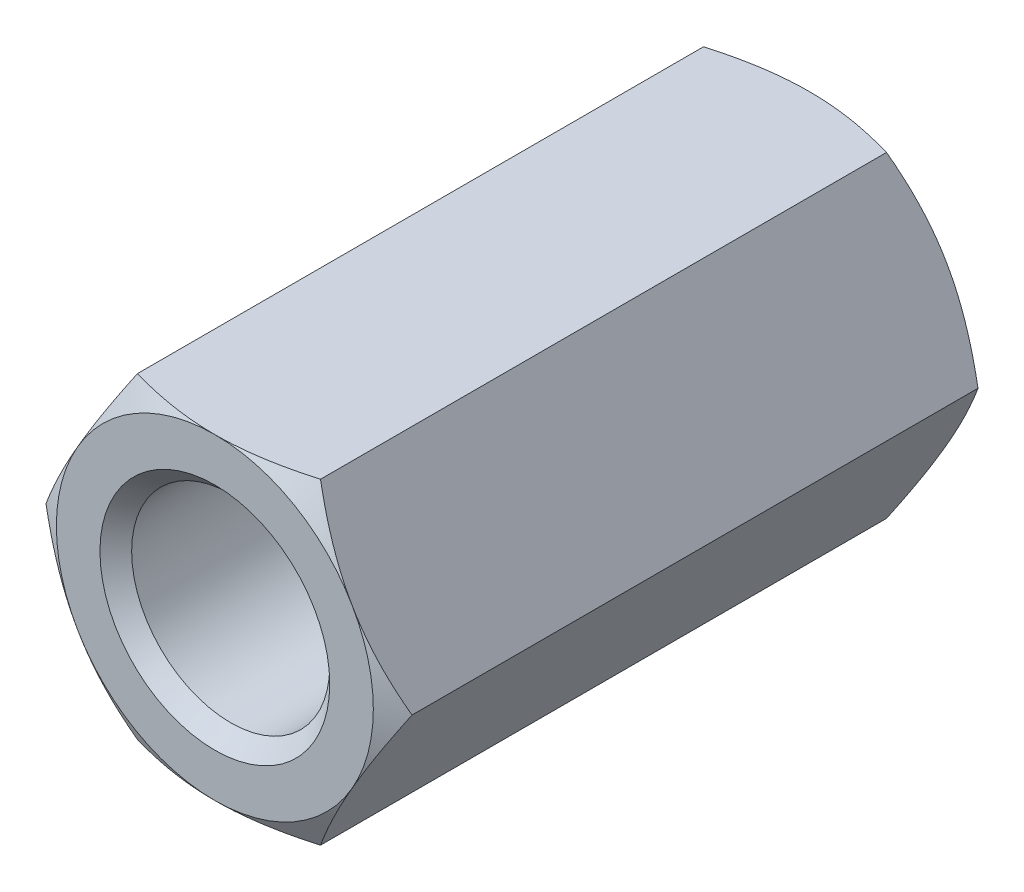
ISO-10303-21;
HEADER;
FILE_DESCRIPTION(('STEP AP214'),'2;1');
FILE_NAME('part.step','',(''),(''),'','','');
FILE_SCHEMA(('AUTOMOTIVE_DESIGN { 1 0 10303 214 1 1 1 1 }'));
ENDSEC;
DATA;
#1=APPLICATION_CONTEXT('core data for automotive mechanical design processes');
#2=APPLICATION_PROTOCOL_DEFINITION('international standard','automotive_design',2000,#1);
#3=PRODUCT_CONTEXT('',#1,'mechanical');
#4=PRODUCT('Part','Part','',(#3));
#5=PRODUCT_RELATED_PRODUCT_CATEGORY('part','',(#4));
#6=PRODUCT_DEFINITION_FORMATION('','',#4);
#7=PRODUCT_DEFINITION_CONTEXT('part definition',#1,'design');
#8=PRODUCT_DEFINITION('design','',#6,#7);
#9=PRODUCT_DEFINITION_SHAPE('','',#8);
#10=(LENGTH_UNIT() NAMED_UNIT(*) SI_UNIT(.MILLI.,.METRE.));
#11=(NAMED_UNIT(*) PLANE_ANGLE_UNIT() SI_UNIT($,.RADIAN.));
#12=(NAMED_UNIT(*) SI_UNIT($,.STERADIAN.) SOLID_ANGLE_UNIT());
#13=UNCERTAINTY_MEASURE_WITH_UNIT(LENGTH_MEASURE(1.E-05),#10,'distance_accuracy_value','');
#14=(GEOMETRIC_REPRESENTATION_CONTEXT(3) GLOBAL_UNCERTAINTY_ASSIGNED_CONTEXT((#13)) GLOBAL_UNIT_ASSIGNED_CONTEXT((#10,
#11,#12)) REPRESENTATION_CONTEXT('',''));
#15=CARTESIAN_POINT('',(0.,0.,0.));
#16=DIRECTION('',(0.,0.,1.));
#17=DIRECTION('',(1.,0.,0.));
#18=AXIS2_PLACEMENT_3D('',#15,#16,#17);
#19=CARTESIAN_POINT('',(4.61880215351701,0.,-7.5));
#20=DIRECTION('',(0.866025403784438,0.5,0.));
#21=DIRECTION('',(-0.5,0.866025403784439,0.));
#22=AXIS2_PLACEMENT_3D('',#19,#20,#21);
#23=PLANE('',#22);
#24=CARTESIAN_POINT('',(4.61891762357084,-0.000199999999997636,7.14266774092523));
#25=CARTESIAN_POINT('',(4.5174314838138,0.17557915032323,7.20128212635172));
#26=CARTESIAN_POINT('',(4.41506932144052,0.352875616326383,7.25458967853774));
#27=CARTESIAN_POINT('',(4.20857250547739,0.710538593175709,7.3476383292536));
#28=CARTESIAN_POINT('',(4.10443418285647,0.890911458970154,7.3873465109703));
#29=CARTESIAN_POINT('',(3.89744813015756,1.24942181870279,7.44915778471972));
#30=CARTESIAN_POINT('',(3.79463224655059,1.42750415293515,7.47167226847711));
#31=CARTESIAN_POINT('',(3.58851671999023,1.78450671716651,7.49854937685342));
#32=CARTESIAN_POINT('',(3.48521782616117,1.9634256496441,7.50293425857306));
#33=CARTESIAN_POINT('',(3.29219970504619,2.29774284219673,7.49380992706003));
#34=CARTESIAN_POINT('',(3.20245157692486,2.45319115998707,7.48254104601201));
#35=CARTESIAN_POINT('',(3.02354002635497,2.76307505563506,7.44682600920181));
#36=CARTESIAN_POINT('',(2.93437722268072,2.91750956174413,7.42236765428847));
#37=CARTESIAN_POINT('',(2.75509682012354,3.22803232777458,7.36122393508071));
#38=CARTESIAN_POINT('',(2.6650019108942,3.3840812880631,7.32427939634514));
#39=CARTESIAN_POINT('',(2.48615580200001,3.69385183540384,7.24042992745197));
#40=CARTESIAN_POINT('',(2.39740231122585,3.84757739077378,7.19354469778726));
#41=CARTESIAN_POINT('',(2.30928560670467,4.0002,7.14266774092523));
#42=B_SPLINE_CURVE_WITH_KNOTS('',3,(#24,#25,#26,#27,#28,#29,#30,#31,#32,#33,#34,#35,#36,#37,#38,
#39,#40,#41),.UNSPECIFIED.,.F.,.F.,(4,2,2,2,2,2,2,2,4),(0.,0.634047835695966,1.26961969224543,
1.88946157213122,2.50854226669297,3.04757825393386,3.58711366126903,4.13861653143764,
4.68903648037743),.UNSPECIFIED.);
#43=CARTESIAN_POINT('',(4.61880215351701,0.,7.14273441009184));
#44=VERTEX_POINT('',#43);
#45=CARTESIAN_POINT('',(3.46410161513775,2.,7.5));
#46=VERTEX_POINT('',#45);
#47=EDGE_CURVE('E127',#44,#46,#42,.T.);
#48=ORIENTED_EDGE('',*,*,#47,.F.);
#49=DIRECTION('',(0.,0.,1.));
#50=VECTOR('',#49,1.);
#51=CARTESIAN_POINT('',(4.61880215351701,0.,-7.5));
#52=LINE('',#51,#50);
#53=CARTESIAN_POINT('',(4.61880215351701,0.,-7.14273441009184));
#54=VERTEX_POINT('',#53);
#55=EDGE_CURVE('E549',#54,#44,#52,.T.);
#56=ORIENTED_EDGE('',*,*,#55,.F.);
#57=CARTESIAN_POINT('',(4.61891762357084,-0.000199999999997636,-7.14266774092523));
#58=CARTESIAN_POINT('',(4.5174314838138,0.17557915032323,-7.20128212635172));
#59=CARTESIAN_POINT('',(4.41506932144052,0.352875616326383,-7.25458967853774));
#60=CARTESIAN_POINT('',(4.20857250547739,0.710538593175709,-7.3476383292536));
#61=CARTESIAN_POINT('',(4.10443418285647,0.890911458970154,-7.3873465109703));
#62=CARTESIAN_POINT('',(3.89744813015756,1.24942181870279,-7.44915778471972));
#63=CARTESIAN_POINT('',(3.79463224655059,1.42750415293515,-7.47167226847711));
#64=CARTESIAN_POINT('',(3.58851671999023,1.78450671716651,-7.49854937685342));
#65=CARTESIAN_POINT('',(3.48521782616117,1.9634256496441,-7.50293425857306));
#66=CARTESIAN_POINT('',(3.29219970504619,2.29774284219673,-7.49380992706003));
#67=CARTESIAN_POINT('',(3.20245157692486,2.45319115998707,-7.48254104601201));
#68=CARTESIAN_POINT('',(3.02354002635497,2.76307505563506,-7.44682600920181));
#69=CARTESIAN_POINT('',(2.93437722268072,2.91750956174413,-7.42236765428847));
#70=CARTESIAN_POINT('',(2.75509682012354,3.22803232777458,-7.36122393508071));
#71=CARTESIAN_POINT('',(2.6650019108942,3.3840812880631,-7.32427939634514));
#72=CARTESIAN_POINT('',(2.48615580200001,3.69385183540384,-7.24042992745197));
#73=CARTESIAN_POINT('',(2.39740231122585,3.84757739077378,-7.19354469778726));
#74=CARTESIAN_POINT('',(2.30928560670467,4.0002,-7.14266774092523));
#75=B_SPLINE_CURVE_WITH_KNOTS('',3,(#57,#58,#59,#60,#61,#62,#63,#64,#65,#66,#67,#68,#69,#70,#71,
#72,#73,#74),.UNSPECIFIED.,.F.,.F.,(4,2,2,2,2,2,2,2,4),(0.,0.634047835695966,1.26961969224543,
1.88946157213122,2.50854226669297,3.04757825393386,3.58711366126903,4.13861653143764,
4.68903648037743),.UNSPECIFIED.);
#76=CARTESIAN_POINT('',(3.46410161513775,2.,-7.5));
#77=VERTEX_POINT('',#76);
#78=EDGE_CURVE('E541',#54,#77,#75,.T.);
#79=ORIENTED_EDGE('',*,*,#78,.T.);
#80=CARTESIAN_POINT('',(2.3094010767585,4.,-7.14273441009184));
#81=VERTEX_POINT('',#80);
#82=EDGE_CURVE('E269',#77,#81,#75,.T.);
#83=ORIENTED_EDGE('',*,*,#82,.T.);
#84=DIRECTION('',(0.,0.,1.));
#85=VECTOR('',#84,1.);
#86=CARTESIAN_POINT('',(2.3094010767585,4.,-7.5));
#87=LINE('',#86,#85);
#88=CARTESIAN_POINT('',(2.30940107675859,4.,7.14273441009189));
#89=VERTEX_POINT('',#88);
#90=EDGE_CURVE('E159',#81,#89,#87,.T.);
#91=ORIENTED_EDGE('',*,*,#90,.T.);
#92=EDGE_CURVE('E140',#46,#89,#42,.T.);
#93=ORIENTED_EDGE('',*,*,#92,.F.);
#94=EDGE_LOOP('',(#48,#56,#79,#83,#91,#93));
#95=FACE_BOUND('',#94,.T.);
#96=ADVANCED_FACE('F41',(#95),#23,.T.);
#97=CARTESIAN_POINT('',(2.3094010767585,-4.,-7.5));
#98=DIRECTION('',(0.866025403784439,-0.5,0.));
#99=DIRECTION('',(0.5,0.866025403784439,0.));
#100=AXIS2_PLACEMENT_3D('',#97,#98,#99);
#101=PLANE('',#100);
#102=CARTESIAN_POINT('',(2.30928560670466,-4.0002,7.14266774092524));
#103=CARTESIAN_POINT('',(2.4107717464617,-3.82442084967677,7.20128212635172));
#104=CARTESIAN_POINT('',(2.51313390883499,-3.64712438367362,7.25458967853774));
#105=CARTESIAN_POINT('',(2.71963072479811,-3.28946140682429,7.3476383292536));
#106=CARTESIAN_POINT('',(2.82376904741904,-3.10908854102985,7.3873465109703));
#107=CARTESIAN_POINT('',(3.03075510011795,-2.75057818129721,7.44915778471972));
#108=CARTESIAN_POINT('',(3.13357098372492,-2.57249584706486,7.47167226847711));
#109=CARTESIAN_POINT('',(3.33968651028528,-2.21549328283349,7.49854937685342));
#110=CARTESIAN_POINT('',(3.44298540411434,-2.0365743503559,7.50293425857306));
#111=CARTESIAN_POINT('',(3.63600352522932,-1.70225715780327,7.49380992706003));
#112=CARTESIAN_POINT('',(3.72575165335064,-1.54680884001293,7.48254104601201));
#113=CARTESIAN_POINT('',(3.90466320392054,-1.23692494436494,7.44682600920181));
#114=CARTESIAN_POINT('',(3.99382600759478,-1.08249043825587,7.42236765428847));
#115=CARTESIAN_POINT('',(4.17310641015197,-0.771967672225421,7.36122393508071));
#116=CARTESIAN_POINT('',(4.26320131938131,-0.615918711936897,7.32427939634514));
#117=CARTESIAN_POINT('',(4.4420474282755,-0.306148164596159,7.24042992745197));
#118=CARTESIAN_POINT('',(4.53080091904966,-0.152422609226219,7.19354469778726));
#119=CARTESIAN_POINT('',(4.61891762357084,0.000200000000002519,7.14266774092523));
#120=B_SPLINE_CURVE_WITH_KNOTS('',3,(#102,#103,#104,#105,#106,#107,#108,#109,#110,#111,#112,
#113,#114,#115,#116,#117,#118,#119),.UNSPECIFIED.,.F.,.F.,(4,2,2,2,2,2,2,2,4),(0.,
0.634047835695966,1.26961969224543,1.88946157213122,2.50854226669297,3.04757825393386,
3.58711366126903,4.13861653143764,4.68903648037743),.UNSPECIFIED.);
#121=CARTESIAN_POINT('',(2.3094010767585,-4.,7.14273441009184));
#122=VERTEX_POINT('',#121);
#123=CARTESIAN_POINT('',(3.46410161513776,-2.,7.5));
#124=VERTEX_POINT('',#123);
#125=EDGE_CURVE('E532',#122,#124,#120,.T.);
#126=ORIENTED_EDGE('',*,*,#125,.F.);
#127=DIRECTION('',(0.,0.,1.));
#128=VECTOR('',#127,1.);
#129=CARTESIAN_POINT('',(2.3094010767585,-4.,-7.5));
#130=LINE('',#129,#128);
#131=CARTESIAN_POINT('',(2.3094010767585,-4.,-7.14273441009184));
#132=VERTEX_POINT('',#131);
#133=EDGE_CURVE('E283',#132,#122,#130,.T.);
#134=ORIENTED_EDGE('',*,*,#133,.F.);
#135=CARTESIAN_POINT('',(2.30928560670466,-4.0002,-7.14266774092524));
#136=CARTESIAN_POINT('',(2.4107717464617,-3.82442084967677,-7.20128212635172));
#137=CARTESIAN_POINT('',(2.51313390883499,-3.64712438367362,-7.25458967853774));
#138=CARTESIAN_POINT('',(2.71963072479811,-3.28946140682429,-7.3476383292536));
#139=CARTESIAN_POINT('',(2.82376904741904,-3.10908854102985,-7.3873465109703));
#140=CARTESIAN_POINT('',(3.03075510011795,-2.75057818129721,-7.44915778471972));
#141=CARTESIAN_POINT('',(3.13357098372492,-2.57249584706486,-7.47167226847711));
#142=CARTESIAN_POINT('',(3.33968651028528,-2.21549328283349,-7.49854937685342));
#143=CARTESIAN_POINT('',(3.44298540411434,-2.0365743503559,-7.50293425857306));
#144=CARTESIAN_POINT('',(3.63600352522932,-1.70225715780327,-7.49380992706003));
#145=CARTESIAN_POINT('',(3.72575165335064,-1.54680884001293,-7.48254104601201));
#146=CARTESIAN_POINT('',(3.90466320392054,-1.23692494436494,-7.44682600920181));
#147=CARTESIAN_POINT('',(3.99382600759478,-1.08249043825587,-7.42236765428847));
#148=CARTESIAN_POINT('',(4.17310641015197,-0.771967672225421,-7.36122393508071));
#149=CARTESIAN_POINT('',(4.26320131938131,-0.615918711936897,-7.32427939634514));
#150=CARTESIAN_POINT('',(4.4420474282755,-0.306148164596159,-7.24042992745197));
#151=CARTESIAN_POINT('',(4.53080091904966,-0.152422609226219,-7.19354469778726));
#152=CARTESIAN_POINT('',(4.61891762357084,0.000200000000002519,-7.14266774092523));
#153=B_SPLINE_CURVE_WITH_KNOTS('',3,(#135,#136,#137,#138,#139,#140,#141,#142,#143,#144,#145,
#146,#147,#148,#149,#150,#151,#152),.UNSPECIFIED.,.F.,.F.,(4,2,2,2,2,2,2,2,4),(0.,
0.634047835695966,1.26961969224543,1.88946157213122,2.50854226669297,3.04757825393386,
3.58711366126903,4.13861653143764,4.68903648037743),.UNSPECIFIED.);
#154=CARTESIAN_POINT('',(3.46410161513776,-2.,-7.5));
#155=VERTEX_POINT('',#154);
#156=EDGE_CURVE('E550',#132,#155,#153,.T.);
#157=ORIENTED_EDGE('',*,*,#156,.T.);
#158=EDGE_CURVE('E284',#155,#54,#153,.T.);
#159=ORIENTED_EDGE('',*,*,#158,.T.);
#160=ORIENTED_EDGE('',*,*,#55,.T.);
#161=EDGE_CURVE('E132',#124,#44,#120,.T.);
#162=ORIENTED_EDGE('',*,*,#161,.F.);
#163=EDGE_LOOP('',(#126,#134,#157,#159,#160,#162));
#164=FACE_BOUND('',#163,.T.);
#165=ADVANCED_FACE('F254',(#164),#101,.T.);
#166=CARTESIAN_POINT('',(-2.3094010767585,-4.,-7.5));
#167=DIRECTION('',(0.,-1.,0.));
#168=DIRECTION('',(0.,0.,-1.));
#169=AXIS2_PLACEMENT_3D('',#166,#167,#168);
#170=PLANE('',#169);
#171=CARTESIAN_POINT('',(-14.5408129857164,-4.,1.10240690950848));
#172=CARTESIAN_POINT('',(-14.221593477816,-4.,1.28009811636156));
#173=CARTESIAN_POINT('',(-13.9022061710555,-4.,1.45748882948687));
#174=CARTESIAN_POINT('',(-13.2630046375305,-4.,1.81150518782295));
#175=CARTESIAN_POINT('',(-12.9431904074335,-4.,1.98813082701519));
#176=CARTESIAN_POINT('',(-12.3029388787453,-4.,2.34051061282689));
#177=CARTESIAN_POINT('',(-11.9825014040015,-4.,2.51626443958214));
#178=CARTESIAN_POINT('',(-11.3409905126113,-4.,2.86660576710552));
#179=CARTESIAN_POINT('',(-11.0199170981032,-4.,3.04119327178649));
#180=CARTESIAN_POINT('',(-10.3751080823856,-4.,3.38989866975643));
#181=CARTESIAN_POINT('',(-10.0513678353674,-4.,3.56400798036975));
#182=CARTESIAN_POINT('',(-9.40285488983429,-4.,3.91029223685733));
#183=CARTESIAN_POINT('',(-9.07808219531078,-4.,4.08246719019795));
#184=CARTESIAN_POINT('',(-8.42724361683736,-4.,4.42423297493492));
#185=CARTESIAN_POINT('',(-8.10117794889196,-4.,4.59382421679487));
#186=CARTESIAN_POINT('',(-7.44726728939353,-4.,4.92953095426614));
#187=CARTESIAN_POINT('',(-7.11942233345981,-4.,5.09564651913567));
#188=CARTESIAN_POINT('',(-6.46063666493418,-4.,5.42337538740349));
#189=CARTESIAN_POINT('',(-6.12969099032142,-4.,5.58497878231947));
#190=CARTESIAN_POINT('',(-5.63070639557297,-4.,5.82208703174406));
#191=CARTESIAN_POINT('',(-5.46393081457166,-4.,5.90024916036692));
#192=CARTESIAN_POINT('',(-5.12937560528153,-4.,6.05439091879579));
#193=CARTESIAN_POINT('',(-4.96159599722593,-4.,6.13037059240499));
#194=CARTESIAN_POINT('',(-4.62450038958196,-4.,6.2797968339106));
#195=CARTESIAN_POINT('',(-4.45518195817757,-4.,6.353237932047));
#196=CARTESIAN_POINT('',(-4.11512999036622,-4.,6.49675716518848));
#197=CARTESIAN_POINT('',(-3.94439652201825,-4.,6.566835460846));
#198=CARTESIAN_POINT('',(-3.60127780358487,-4.,6.70276199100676));
#199=CARTESIAN_POINT('',(-3.42889284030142,-4.,6.76861094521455));
#200=CARTESIAN_POINT('',(-3.08218393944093,-4.,6.89496602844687));
#201=CARTESIAN_POINT('',(-2.90786018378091,-4.,6.955472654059));
#202=CARTESIAN_POINT('',(-2.5066039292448,-4.,7.08615402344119));
#203=CARTESIAN_POINT('',(-2.27893917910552,-4.,7.15411564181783));
#204=CARTESIAN_POINT('',(-1.81956523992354,-4.,7.27502568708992));
#205=CARTESIAN_POINT('',(-1.58785668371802,-4.,7.32797644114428));
#206=CARTESIAN_POINT('',(-1.23876481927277,-4.,7.39261696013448));
#207=CARTESIAN_POINT('',(-1.12272702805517,-4.,7.41164095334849));
#208=CARTESIAN_POINT('',(-0.889906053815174,-4.,7.44443467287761));
#209=CARTESIAN_POINT('',(-0.773122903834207,-4.,7.45820463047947));
#210=CARTESIAN_POINT('',(-0.539058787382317,-4.,7.48007686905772));
#211=CARTESIAN_POINT('',(-0.421777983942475,-4.,7.4881808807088));
#212=CARTESIAN_POINT('',(-0.186938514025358,-4.,7.49846785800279));
#213=CARTESIAN_POINT('',(-0.0693798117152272,-4.,7.500650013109));
#214=CARTESIAN_POINT('',(0.165637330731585,-4.,7.4990156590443));
#215=CARTESIAN_POINT('',(0.283095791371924,-4.,7.49520222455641));
#216=CARTESIAN_POINT('',(0.517681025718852,-4.,7.48171656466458));
#217=CARTESIAN_POINT('',(0.634807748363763,-4.,7.47204348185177));
#218=CARTESIAN_POINT('',(0.985363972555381,-4.,7.43464979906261));
#219=CARTESIAN_POINT('',(1.21794190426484,-4.,7.39855506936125));
#220=CARTESIAN_POINT('',(1.56650459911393,-4.,7.33004978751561));
#221=CARTESIAN_POINT('',(1.68392411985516,-4.,7.30445870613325));
#222=CARTESIAN_POINT('',(1.91771897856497,-4.,7.24904210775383));
#223=CARTESIAN_POINT('',(2.03409471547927,-4.,7.21921828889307));
#224=CARTESIAN_POINT('',(2.26585169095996,-4.,7.15587210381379));
#225=CARTESIAN_POINT('',(2.38123271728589,-4.,7.12234896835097));
#226=CARTESIAN_POINT('',(2.61101996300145,-4.,7.05211095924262));
#227=CARTESIAN_POINT('',(2.72542613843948,-4.,7.01539594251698));
#228=CARTESIAN_POINT('',(3.11834372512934,-4.,6.88410262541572));
#229=CARTESIAN_POINT('',(3.39458528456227,-4.,6.78272413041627));
#230=CARTESIAN_POINT('',(3.94273843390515,-4.,6.56880005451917));
#231=CARTESIAN_POINT('',(4.21464825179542,-4.,6.45625003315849));
#232=CARTESIAN_POINT('',(4.75543004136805,-4.,6.22323648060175));
#233=CARTESIAN_POINT('',(5.02429789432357,-4.,6.10276344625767));
#234=CARTESIAN_POINT('',(5.55942162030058,-4.,5.85629287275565));
#235=CARTESIAN_POINT('',(5.82567789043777,-4.,5.73029618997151));
#236=CARTESIAN_POINT('',(6.3573976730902,-4.,5.47369105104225));
#237=CARTESIAN_POINT('',(6.62285253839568,-4.,5.34306473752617));
#238=CARTESIAN_POINT('',(7.15224405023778,-4.,5.07875809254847));
#239=CARTESIAN_POINT('',(7.41618064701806,-4.,4.94507766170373));
#240=CARTESIAN_POINT('',(7.9426723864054,-4.,4.6754852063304));
#241=CARTESIAN_POINT('',(8.20522837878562,-4.,4.53957483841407));
#242=CARTESIAN_POINT('',(8.72939472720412,-4.,4.26594135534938));
#243=CARTESIAN_POINT('',(8.99100507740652,-4.,4.12821822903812));
#244=CARTESIAN_POINT('',(9.69765288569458,-4.,3.75374074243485));
#245=CARTESIAN_POINT('',(10.1419692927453,-4.,3.51562647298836));
#246=CARTESIAN_POINT('',(11.0291375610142,-4.,3.0364779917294));
#247=CARTESIAN_POINT('',(11.471989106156,-4.,2.79544319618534));
#248=CARTESIAN_POINT('',(12.3530231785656,-4.,2.3132336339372));
#249=CARTESIAN_POINT('',(12.7912147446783,-4.,2.07207536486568));
#250=CARTESIAN_POINT('',(13.6666416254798,-4.,1.58825815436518));
#251=CARTESIAN_POINT('',(14.1038771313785,-4.,1.3455995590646));
#252=CARTESIAN_POINT('',(14.5408129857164,-4.,1.10240690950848));
#253=B_SPLINE_CURVE_WITH_KNOTS('',3,(#171,#172,#173,#174,#175,#176,#177,#178,#179,#180,#181,
#182,#183,#184,#185,#186,#187,#188,#189,#190,#191,#192,#193,#194,#195,#196,#197,#198,#199,#200,
#201,#202,#203,#204,#205,#206,#207,#208,#209,#210,#211,#212,#213,#214,#215,#216,#217,#218,#219,
#220,#221,#222,#223,#224,#225,#226,#227,#228,#229,#230,#231,#232,#233,#234,#235,#236,#237,#238,
#239,#240,#241,#242,#243,#244,#245,#246,#247,#248,#249,#250,#251,#252),.UNSPECIFIED.,.F.,.F.,(4,
2,2,2,2,2,2,2,2,2,2,2,2,2,2,2,2,2,2,2,2,2,2,2,2,2,2,2,2,2,2,2,2,2,2,2,2,2,2,2,4),(0.,
1.09602851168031,2.1920656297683,3.28847886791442,4.3848884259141,5.48765091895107,
6.59040915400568,7.69299033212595,8.79554951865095,9.90036485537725,10.4529020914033,
11.0054282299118,11.5590788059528,12.1127029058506,12.6662325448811,13.2197106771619,
13.9321254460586,14.6444297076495,14.9970899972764,15.3497347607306,15.7022717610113,
16.0548570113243,16.4072615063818,16.7597175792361,17.4647122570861,17.8251870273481,
18.1855175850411,18.5459232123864,18.9063450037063,19.7886970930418,20.6714013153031,
21.55518430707,22.4388307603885,23.3263664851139,24.2139311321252,25.100863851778,
25.9878020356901,27.5000807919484,29.0126669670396,30.5131707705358,32.0133404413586),.UNSPECIFIED.);
#254=CARTESIAN_POINT('',(-2.3094010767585,-4.,7.14273441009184));
#255=VERTEX_POINT('',#254);
#256=CARTESIAN_POINT('',(0.,-4.,7.5));
#257=VERTEX_POINT('',#256);
#258=EDGE_CURVE('E533',#255,#257,#253,.T.);
#259=ORIENTED_EDGE('',*,*,#258,.F.);
#260=DIRECTION('',(0.,0.,1.));
#261=VECTOR('',#260,1.);
#262=CARTESIAN_POINT('',(-2.3094010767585,-4.,-7.5));
#263=LINE('',#262,#261);
#264=CARTESIAN_POINT('',(-2.3094010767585,-4.,-7.14273441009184));
#265=VERTEX_POINT('',#264);
#266=EDGE_CURVE('E587',#265,#255,#263,.T.);
#267=ORIENTED_EDGE('',*,*,#266,.F.);
#268=CARTESIAN_POINT('',(-10.0385448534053,-4.,-3.57048069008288));
#269=CARTESIAN_POINT('',(-9.81237081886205,-4.,-3.69177532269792));
#270=CARTESIAN_POINT('',(-9.58597098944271,-4.,-3.81265143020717));
#271=CARTESIAN_POINT('',(-9.13260413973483,-4.,-4.05334886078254));
#272=CARTESIAN_POINT('',(-8.90563710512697,-4.,-4.17317015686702));
#273=CARTESIAN_POINT('',(-8.45081149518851,-4.,-4.41164951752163));
#274=CARTESIAN_POINT('',(-8.22295226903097,-4.,-4.5303063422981));
#275=CARTESIAN_POINT('',(-7.76641505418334,-4.,-4.7660305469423));
#276=CARTESIAN_POINT('',(-7.53773707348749,-4.,-4.88309794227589));
#277=CARTESIAN_POINT('',(-7.06933953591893,-4.,-5.12032308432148));
#278=CARTESIAN_POINT('',(-6.82957480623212,-4.,-5.24039180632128));
#279=CARTESIAN_POINT('',(-6.34866719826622,-4.,-5.47773504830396));
#280=CARTESIAN_POINT('',(-6.10752433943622,-4.,-5.59500960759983));
#281=CARTESIAN_POINT('',(-5.62357319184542,-4.,-5.82585277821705));
#282=CARTESIAN_POINT('',(-5.38076554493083,-4.,-5.93942273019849));
#283=CARTESIAN_POINT('',(-4.89292133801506,-4.,-6.16165276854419));
#284=CARTESIAN_POINT('',(-4.64788491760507,-4.,-6.27031315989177));
#285=CARTESIAN_POINT('',(-4.13913810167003,-4.,-6.48769090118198));
#286=CARTESIAN_POINT('',(-3.87523704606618,-4.,-6.59596594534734));
#287=CARTESIAN_POINT('',(-3.34313744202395,-4.,-6.80177171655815));
#288=CARTESIAN_POINT('',(-3.07493775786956,-4.,-6.89929954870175));
#289=CARTESIAN_POINT('',(-2.53690273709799,-4.,-7.07761328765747));
#290=CARTESIAN_POINT('',(-2.26713719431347,-4.,-7.15860557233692));
#291=CARTESIAN_POINT('',(-1.7220063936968,-4.,-7.29901886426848));
#292=CARTESIAN_POINT('',(-1.4466444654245,-4.,-7.35845232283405));
#293=CARTESIAN_POINT('',(-0.948411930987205,-4.,-7.43910621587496));
#294=CARTESIAN_POINT('',(-0.726437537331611,-4.,-7.46568183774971));
#295=CARTESIAN_POINT('',(-0.392410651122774,-4.,-7.48979606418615));
#296=CARTESIAN_POINT('',(-0.280896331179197,-4.,-7.49520939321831));
#297=CARTESIAN_POINT('',(-0.0577290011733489,-4.,-7.50065476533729));
#298=CARTESIAN_POINT('',(0.0539240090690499,-4.,-7.50068680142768));
#299=CARTESIAN_POINT('',(0.277408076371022,-4.,-7.49535352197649));
#300=CARTESIAN_POINT('',(0.389238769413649,-4.,-7.48997324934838));
#301=CARTESIAN_POINT('',(0.612523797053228,-4.,-7.47395589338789));
#302=CARTESIAN_POINT('',(0.723978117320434,-4.,-7.46331861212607));
#303=CARTESIAN_POINT('',(0.946312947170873,-4.,-7.43708437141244));
#304=CARTESIAN_POINT('',(1.05719337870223,-4.,-7.42148675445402));
#305=CARTESIAN_POINT('',(1.27820077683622,-4.,-7.38572987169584));
#306=CARTESIAN_POINT('',(1.38832777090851,-4.,-7.36557077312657));
#307=CARTESIAN_POINT('',(1.82124485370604,-4.,-7.27791573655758));
#308=CARTESIAN_POINT('',(2.14089809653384,-4.,-7.19463412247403));
#309=CARTESIAN_POINT('',(2.61471205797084,-4.,-7.05146733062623));
#310=CARTESIAN_POINT('',(2.77182531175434,-4.,-7.00065786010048));
#311=CARTESIAN_POINT('',(3.08436652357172,-4.,-6.8940728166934));
#312=CARTESIAN_POINT('',(3.23979461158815,-4.,-6.83829762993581));
#313=CARTESIAN_POINT('',(3.54979266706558,-4.,-6.72249343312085));
#314=CARTESIAN_POINT('',(3.70435619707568,-4.,-6.66244738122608));
#315=CARTESIAN_POINT('',(4.01216881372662,-4.,-6.53906670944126));
#316=CARTESIAN_POINT('',(4.16541784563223,-4.,-6.47573195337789));
#317=CARTESIAN_POINT('',(4.6232839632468,-4.,-6.28181875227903));
#318=CARTESIAN_POINT('',(4.92621191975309,-4.,-6.14725788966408));
#319=CARTESIAN_POINT('',(5.53264594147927,-4.,-5.86918264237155));
#320=CARTESIAN_POINT('',(5.83610869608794,-4.,-5.72557487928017));
#321=CARTESIAN_POINT('',(6.4405648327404,-4.,-5.4331895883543));
#322=CARTESIAN_POINT('',(6.74155794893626,-4.,-5.28441151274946));
#323=CARTESIAN_POINT('',(7.34103068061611,-4.,-4.98346729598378));
#324=CARTESIAN_POINT('',(7.63951430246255,-4.,-4.83130910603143));
#325=CARTESIAN_POINT('',(8.23505607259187,-4.,-4.52425794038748));
#326=CARTESIAN_POINT('',(8.53211426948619,-4.,-4.36936505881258));
#327=CARTESIAN_POINT('',(9.03140451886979,-4.,-4.10679108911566));
#328=CARTESIAN_POINT('',(9.23392835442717,-4.,-3.99966364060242));
#329=CARTESIAN_POINT('',(9.63720762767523,-4.,-3.78529196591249));
#330=CARTESIAN_POINT('',(9.83796593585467,-4.,-3.67805314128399));
#331=CARTESIAN_POINT('',(10.0385448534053,-4.,-3.57048069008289));
#332=B_SPLINE_CURVE_WITH_KNOTS('',3,(#268,#269,#270,#271,#272,#273,#274,#275,#276,#277,#278,
#279,#280,#281,#282,#283,#284,#285,#286,#287,#288,#289,#290,#291,#292,#293,#294,#295,#296,#297,
#298,#299,#300,#301,#302,#303,#304,#305,#306,#307,#308,#309,#310,#311,#312,#313,#314,#315,#316,
#317,#318,#319,#320,#321,#322,#323,#324,#325,#326,#327,#328,#329,#330,#331),.UNSPECIFIED.,.F.,
.F.,(4,2,2,2,2,2,2,2,2,2,2,2,2,2,2,2,2,2,2,2,2,2,2,2,2,2,2,2,2,2,2,4),(0.,0.769938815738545,
1.53989726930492,2.31060187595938,3.08129897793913,3.88573058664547,4.6901508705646,
5.49427673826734,6.29835258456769,7.15394023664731,8.00975779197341,8.85413475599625,
9.69802327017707,10.3677367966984,10.7025605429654,11.0373847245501,11.3731367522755,
11.7089014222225,12.0447106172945,12.3805075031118,13.3696680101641,13.8650168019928,
14.3603271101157,14.8577386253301,15.3551707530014,16.3494190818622,17.3565422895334,
18.3637725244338,19.36884243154,20.3738778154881,21.0612113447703,21.7440245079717),.UNSPECIFIED.);
#333=CARTESIAN_POINT('',(0.,-4.,-7.5));
#334=VERTEX_POINT('',#333);
#335=EDGE_CURVE('E593',#265,#334,#332,.T.);
#336=ORIENTED_EDGE('',*,*,#335,.T.);
#337=EDGE_CURVE('E259',#334,#132,#332,.T.);
#338=ORIENTED_EDGE('',*,*,#337,.T.);
#339=ORIENTED_EDGE('',*,*,#133,.T.);
#340=EDGE_CURVE('E138',#257,#122,#253,.T.);
#341=ORIENTED_EDGE('',*,*,#340,.F.);
#342=EDGE_LOOP('',(#259,#267,#336,#338,#339,#341));
#343=FACE_BOUND('',#342,.T.);
#344=ADVANCED_FACE('F292',(#343),#170,.T.);
#345=CARTESIAN_POINT('',(-4.61880215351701,0.,-7.5));
#346=DIRECTION('',(-0.866025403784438,-0.5,0.));
#347=DIRECTION('',(0.5,-0.866025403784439,0.));
#348=AXIS2_PLACEMENT_3D('',#345,#346,#347);
#349=PLANE('',#348);
#350=CARTESIAN_POINT('',(-4.61891762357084,0.000199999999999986,7.14266774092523));
#351=CARTESIAN_POINT('',(-4.51743148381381,-0.175579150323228,7.20128212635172));
#352=CARTESIAN_POINT('',(-4.41506932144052,-0.352875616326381,7.25458967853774));
#353=CARTESIAN_POINT('',(-4.20857250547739,-0.710538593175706,7.3476383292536));
#354=CARTESIAN_POINT('',(-4.10443418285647,-0.890911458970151,7.3873465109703));
#355=CARTESIAN_POINT('',(-3.89744813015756,-1.24942181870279,7.44915778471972));
#356=CARTESIAN_POINT('',(-3.79463224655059,-1.42750415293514,7.47167226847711));
#357=CARTESIAN_POINT('',(-3.58851671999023,-1.78450671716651,7.49854937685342));
#358=CARTESIAN_POINT('',(-3.48521782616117,-1.9634256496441,7.50293425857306));
#359=CARTESIAN_POINT('',(-3.29219970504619,-2.29774284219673,7.49380992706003));
#360=CARTESIAN_POINT('',(-3.20245157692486,-2.45319115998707,7.48254104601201));
#361=CARTESIAN_POINT('',(-3.02354002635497,-2.76307505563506,7.44682600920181));
#362=CARTESIAN_POINT('',(-2.93437722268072,-2.91750956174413,7.42236765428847));
#363=CARTESIAN_POINT('',(-2.75509682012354,-3.22803232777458,7.36122393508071));
#364=CARTESIAN_POINT('',(-2.6650019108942,-3.3840812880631,7.32427939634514));
#365=CARTESIAN_POINT('',(-2.48615580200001,-3.69385183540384,7.24042992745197));
#366=CARTESIAN_POINT('',(-2.39740231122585,-3.84757739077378,7.19354469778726));
#367=CARTESIAN_POINT('',(-2.30928560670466,-4.0002,7.14266774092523));
#368=B_SPLINE_CURVE_WITH_KNOTS('',3,(#350,#351,#352,#353,#354,#355,#356,#357,#358,#359,#360,
#361,#362,#363,#364,#365,#366,#367),.UNSPECIFIED.,.F.,.F.,(4,2,2,2,2,2,2,2,4),(0.,
0.634047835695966,1.26961969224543,1.88946157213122,2.50854226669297,3.04757825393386,
3.58711366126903,4.13861653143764,4.68903648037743),.UNSPECIFIED.);
#369=CARTESIAN_POINT('',(-4.61880215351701,0.,7.14273441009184));
#370=VERTEX_POINT('',#369);
#371=CARTESIAN_POINT('',(-3.46410161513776,-2.,7.5));
#372=VERTEX_POINT('',#371);
#373=EDGE_CURVE('E176',#370,#372,#368,.T.);
#374=ORIENTED_EDGE('',*,*,#373,.F.);
#375=DIRECTION('',(0.,0.,1.));
#376=VECTOR('',#375,1.);
#377=CARTESIAN_POINT('',(-4.61880215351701,0.,-7.5));
#378=LINE('',#377,#376);
#379=CARTESIAN_POINT('',(-4.61880215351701,0.,-7.14273441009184));
#380=VERTEX_POINT('',#379);
#381=EDGE_CURVE('E558',#380,#370,#378,.T.);
#382=ORIENTED_EDGE('',*,*,#381,.F.);
#383=CARTESIAN_POINT('',(-4.61891762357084,0.000199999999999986,-7.14266774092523));
#384=CARTESIAN_POINT('',(-4.51743148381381,-0.175579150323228,-7.20128212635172));
#385=CARTESIAN_POINT('',(-4.41506932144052,-0.352875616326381,-7.25458967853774));
#386=CARTESIAN_POINT('',(-4.20857250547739,-0.710538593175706,-7.3476383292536));
#387=CARTESIAN_POINT('',(-4.10443418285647,-0.890911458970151,-7.3873465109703));
#388=CARTESIAN_POINT('',(-3.89744813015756,-1.24942181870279,-7.44915778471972));
#389=CARTESIAN_POINT('',(-3.79463224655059,-1.42750415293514,-7.47167226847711));
#390=CARTESIAN_POINT('',(-3.58851671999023,-1.78450671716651,-7.49854937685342));
#391=CARTESIAN_POINT('',(-3.48521782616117,-1.9634256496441,-7.50293425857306));
#392=CARTESIAN_POINT('',(-3.29219970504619,-2.29774284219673,-7.49380992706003));
#393=CARTESIAN_POINT('',(-3.20245157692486,-2.45319115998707,-7.48254104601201));
#394=CARTESIAN_POINT('',(-3.02354002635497,-2.76307505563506,-7.44682600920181));
#395=CARTESIAN_POINT('',(-2.93437722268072,-2.91750956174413,-7.42236765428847));
#396=CARTESIAN_POINT('',(-2.75509682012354,-3.22803232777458,-7.36122393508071));
#397=CARTESIAN_POINT('',(-2.6650019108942,-3.3840812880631,-7.32427939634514));
#398=CARTESIAN_POINT('',(-2.48615580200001,-3.69385183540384,-7.24042992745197));
#399=CARTESIAN_POINT('',(-2.39740231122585,-3.84757739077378,-7.19354469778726));
#400=CARTESIAN_POINT('',(-2.30928560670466,-4.0002,-7.14266774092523));
#401=B_SPLINE_CURVE_WITH_KNOTS('',3,(#383,#384,#385,#386,#387,#388,#389,#390,#391,#392,#393,
#394,#395,#396,#397,#398,#399,#400),.UNSPECIFIED.,.F.,.F.,(4,2,2,2,2,2,2,2,4),(0.,
0.634047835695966,1.26961969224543,1.88946157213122,2.50854226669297,3.04757825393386,
3.58711366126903,4.13861653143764,4.68903648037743),.UNSPECIFIED.);
#402=CARTESIAN_POINT('',(-3.46410161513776,-2.,-7.5));
#403=VERTEX_POINT('',#402);
#404=EDGE_CURVE('E275',#380,#403,#401,.T.);
#405=ORIENTED_EDGE('',*,*,#404,.T.);
#406=EDGE_CURVE('E282',#403,#265,#401,.T.);
#407=ORIENTED_EDGE('',*,*,#406,.T.);
#408=ORIENTED_EDGE('',*,*,#266,.T.);
#409=EDGE_CURVE('E552',#372,#255,#368,.T.);
#410=ORIENTED_EDGE('',*,*,#409,.F.);
#411=EDGE_LOOP('',(#374,#382,#405,#407,#408,#410));
#412=FACE_BOUND('',#411,.T.);
#413=ADVANCED_FACE('F289',(#412),#349,.T.);
#414=CARTESIAN_POINT('',(-2.3094010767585,4.,-7.5));
#415=DIRECTION('',(-0.866025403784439,0.5,0.));
#416=DIRECTION('',(-0.5,-0.866025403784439,0.));
#417=AXIS2_PLACEMENT_3D('',#414,#415,#416);
#418=PLANE('',#417);
#419=CARTESIAN_POINT('',(-2.30928560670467,4.0002,7.14266774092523));
#420=CARTESIAN_POINT('',(-2.41077174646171,3.82442084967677,7.20128212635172));
#421=CARTESIAN_POINT('',(-2.513133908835,3.64712438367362,7.25458967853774));
#422=CARTESIAN_POINT('',(-2.71963072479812,3.28946140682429,7.3476383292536));
#423=CARTESIAN_POINT('',(-2.82376904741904,3.10908854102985,7.3873465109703));
#424=CARTESIAN_POINT('',(-3.03075510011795,2.75057818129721,7.44915778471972));
#425=CARTESIAN_POINT('',(-3.13357098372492,2.57249584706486,7.47167226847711));
#426=CARTESIAN_POINT('',(-3.33968651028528,2.21549328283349,7.49854937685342));
#427=CARTESIAN_POINT('',(-3.44298540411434,2.0365743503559,7.50293425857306));
#428=CARTESIAN_POINT('',(-3.63600352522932,1.70225715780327,7.49380992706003));
#429=CARTESIAN_POINT('',(-3.72575165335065,1.54680884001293,7.48254104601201));
#430=CARTESIAN_POINT('',(-3.90466320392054,1.23692494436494,7.44682600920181));
#431=CARTESIAN_POINT('',(-3.99382600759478,1.08249043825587,7.42236765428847));
#432=CARTESIAN_POINT('',(-4.17310641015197,0.771967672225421,7.36122393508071));
#433=CARTESIAN_POINT('',(-4.26320131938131,0.615918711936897,7.32427939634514));
#434=CARTESIAN_POINT('',(-4.4420474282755,0.30614816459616,7.24042992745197));
#435=CARTESIAN_POINT('',(-4.53080091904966,0.15242260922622,7.19354469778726));
#436=CARTESIAN_POINT('',(-4.61891762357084,-0.000200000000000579,7.14266774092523));
#437=B_SPLINE_CURVE_WITH_KNOTS('',3,(#419,#420,#421,#422,#423,#424,#425,#426,#427,#428,#429,
#430,#431,#432,#433,#434,#435,#436),.UNSPECIFIED.,.F.,.F.,(4,2,2,2,2,2,2,2,4),(0.,
0.634047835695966,1.26961969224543,1.88946157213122,2.50854226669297,3.04757825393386,
3.58711366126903,4.13861653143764,4.68903648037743),.UNSPECIFIED.);
#438=CARTESIAN_POINT('',(-2.309401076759,4.,7.14273441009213));
#439=VERTEX_POINT('',#438);
#440=CARTESIAN_POINT('',(-3.46410161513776,2.,7.5));
#441=VERTEX_POINT('',#440);
#442=EDGE_CURVE('E183',#439,#441,#437,.T.);
#443=ORIENTED_EDGE('',*,*,#442,.F.);
#444=DIRECTION('',(0.,0.,1.));
#445=VECTOR('',#444,1.);
#446=CARTESIAN_POINT('',(-2.3094010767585,4.,-7.5));
#447=LINE('',#446,#445);
#448=CARTESIAN_POINT('',(-2.3094010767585,4.,-7.14273441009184));
#449=VERTEX_POINT('',#448);
#450=EDGE_CURVE('E233',#449,#439,#447,.T.);
#451=ORIENTED_EDGE('',*,*,#450,.F.);
#452=CARTESIAN_POINT('',(-2.30928560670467,4.0002,-7.14266774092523));
#453=CARTESIAN_POINT('',(-2.41077174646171,3.82442084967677,-7.20128212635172));
#454=CARTESIAN_POINT('',(-2.513133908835,3.64712438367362,-7.25458967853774));
#455=CARTESIAN_POINT('',(-2.71963072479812,3.28946140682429,-7.3476383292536));
#456=CARTESIAN_POINT('',(-2.82376904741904,3.10908854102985,-7.3873465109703));
#457=CARTESIAN_POINT('',(-3.03075510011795,2.75057818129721,-7.44915778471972));
#458=CARTESIAN_POINT('',(-3.13357098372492,2.57249584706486,-7.47167226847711));
#459=CARTESIAN_POINT('',(-3.33968651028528,2.21549328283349,-7.49854937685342));
#460=CARTESIAN_POINT('',(-3.44298540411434,2.0365743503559,-7.50293425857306));
#461=CARTESIAN_POINT('',(-3.63600352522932,1.70225715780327,-7.49380992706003));
#462=CARTESIAN_POINT('',(-3.72575165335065,1.54680884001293,-7.48254104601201));
#463=CARTESIAN_POINT('',(-3.90466320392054,1.23692494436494,-7.44682600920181));
#464=CARTESIAN_POINT('',(-3.99382600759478,1.08249043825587,-7.42236765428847));
#465=CARTESIAN_POINT('',(-4.17310641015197,0.771967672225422,-7.36122393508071));
#466=CARTESIAN_POINT('',(-4.26320131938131,0.615918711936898,-7.32427939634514));
#467=CARTESIAN_POINT('',(-4.4420474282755,0.306148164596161,-7.24042992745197));
#468=CARTESIAN_POINT('',(-4.53080091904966,0.152422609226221,-7.19354469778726));
#469=CARTESIAN_POINT('',(-4.61891762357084,-0.000199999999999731,-7.14266774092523));
#470=B_SPLINE_CURVE_WITH_KNOTS('',3,(#452,#453,#454,#455,#456,#457,#458,#459,#460,#461,#462,
#463,#464,#465,#466,#467,#468,#469),.UNSPECIFIED.,.F.,.F.,(4,2,2,2,2,2,2,2,4),(0.,
0.634047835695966,1.26961969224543,1.88946157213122,2.50854226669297,3.04757825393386,
3.58711366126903,4.13861653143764,4.68903648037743),.UNSPECIFIED.);
#471=CARTESIAN_POINT('',(-3.46410161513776,2.,-7.5));
#472=VERTEX_POINT('',#471);
#473=EDGE_CURVE('E237',#449,#472,#470,.T.);
#474=ORIENTED_EDGE('',*,*,#473,.T.);
#475=EDGE_CURVE('E561',#472,#380,#470,.T.);
#476=ORIENTED_EDGE('',*,*,#475,.T.);
#477=ORIENTED_EDGE('',*,*,#381,.T.);
#478=EDGE_CURVE('E530',#441,#370,#437,.T.);
#479=ORIENTED_EDGE('',*,*,#478,.F.);
#480=EDGE_LOOP('',(#443,#451,#474,#476,#477,#479));
#481=FACE_BOUND('',#480,.T.);
#482=ADVANCED_FACE('F218',(#481),#418,.T.);
#483=CARTESIAN_POINT('',(2.3094010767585,4.,-7.5));
#484=DIRECTION('',(0.,1.,0.));
#485=DIRECTION('',(0.,0.,1.));
#486=AXIS2_PLACEMENT_3D('',#483,#484,#485);
#487=PLANE('',#486);
#488=CARTESIAN_POINT('',(14.5408129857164,4.,1.10240690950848));
#489=CARTESIAN_POINT('',(14.221593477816,4.,1.28009811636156));
#490=CARTESIAN_POINT('',(13.9022061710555,4.,1.45748882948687));
#491=CARTESIAN_POINT('',(13.2630046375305,4.,1.81150518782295));
#492=CARTESIAN_POINT('',(12.9431904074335,4.,1.98813082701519));
#493=CARTESIAN_POINT('',(12.3029388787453,4.,2.34051061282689));
#494=CARTESIAN_POINT('',(11.9825014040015,4.,2.51626443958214));
#495=CARTESIAN_POINT('',(11.3409905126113,4.,2.86660576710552));
#496=CARTESIAN_POINT('',(11.0199170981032,4.,3.04119327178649));
#497=CARTESIAN_POINT('',(10.3751080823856,4.,3.38989866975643));
#498=CARTESIAN_POINT('',(10.0513678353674,4.,3.56400798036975));
#499=CARTESIAN_POINT('',(9.40285488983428,4.,3.91029223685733));
#500=CARTESIAN_POINT('',(9.07808219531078,4.,4.08246719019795));
#501=CARTESIAN_POINT('',(8.42724361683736,4.,4.42423297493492));
#502=CARTESIAN_POINT('',(8.10117794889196,4.,4.59382421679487));
#503=CARTESIAN_POINT('',(7.44726728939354,4.,4.92953095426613));
#504=CARTESIAN_POINT('',(7.11942233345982,4.,5.09564651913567));
#505=CARTESIAN_POINT('',(6.46063666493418,4.,5.42337538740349));
#506=CARTESIAN_POINT('',(6.12969099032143,4.,5.58497878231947));
#507=CARTESIAN_POINT('',(5.63070639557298,4.,5.82208703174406));
#508=CARTESIAN_POINT('',(5.46393081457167,4.,5.90024916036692));
#509=CARTESIAN_POINT('',(5.12937560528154,4.,6.05439091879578));
#510=CARTESIAN_POINT('',(4.96159599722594,4.,6.13037059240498));
#511=CARTESIAN_POINT('',(4.62450038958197,4.,6.27979683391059));
#512=CARTESIAN_POINT('',(4.45518195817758,4.,6.353237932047));
#513=CARTESIAN_POINT('',(4.11512999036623,4.,6.49675716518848));
#514=CARTESIAN_POINT('',(3.94439652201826,4.,6.56683546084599));
#515=CARTESIAN_POINT('',(3.60127780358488,4.,6.70276199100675));
#516=CARTESIAN_POINT('',(3.42889284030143,4.,6.76861094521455));
#517=CARTESIAN_POINT('',(3.08218393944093,4.,6.89496602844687));
#518=CARTESIAN_POINT('',(2.90786018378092,4.,6.955472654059));
#519=CARTESIAN_POINT('',(2.5066039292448,4.,7.08615402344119));
#520=CARTESIAN_POINT('',(2.27893917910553,4.,7.15411564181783));
#521=CARTESIAN_POINT('',(1.81956523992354,4.,7.27502568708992));
#522=CARTESIAN_POINT('',(1.58785668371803,4.,7.32797644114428));
#523=CARTESIAN_POINT('',(1.23876481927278,4.,7.39261696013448));
#524=CARTESIAN_POINT('',(1.12272702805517,4.,7.41164095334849));
#525=CARTESIAN_POINT('',(0.889906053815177,4.,7.44443467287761));
#526=CARTESIAN_POINT('',(0.773122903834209,4.,7.45820463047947));
#527=CARTESIAN_POINT('',(0.539058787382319,4.,7.48007686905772));
#528=CARTESIAN_POINT('',(0.421777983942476,4.,7.48818088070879));
#529=CARTESIAN_POINT('',(0.186938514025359,4.,7.49846785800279));
#530=CARTESIAN_POINT('',(0.0693798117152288,4.,7.500650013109));
#531=CARTESIAN_POINT('',(-0.165637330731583,4.,7.4990156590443));
#532=CARTESIAN_POINT('',(-0.283095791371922,4.,7.49520222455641));
#533=CARTESIAN_POINT('',(-0.51768102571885,4.,7.48171656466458));
#534=CARTESIAN_POINT('',(-0.634807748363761,4.,7.47204348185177));
#535=CARTESIAN_POINT('',(-0.98536397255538,4.,7.43464979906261));
#536=CARTESIAN_POINT('',(-1.21794190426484,4.,7.39855506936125));
#537=CARTESIAN_POINT('',(-1.56650459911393,4.,7.33004978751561));
#538=CARTESIAN_POINT('',(-1.68392411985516,4.,7.30445870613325));
#539=CARTESIAN_POINT('',(-1.91771897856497,4.,7.24904210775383));
#540=CARTESIAN_POINT('',(-2.03409471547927,4.,7.21921828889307));
#541=CARTESIAN_POINT('',(-2.26585169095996,4.,7.15587210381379));
#542=CARTESIAN_POINT('',(-2.38123271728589,4.,7.12234896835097));
#543=CARTESIAN_POINT('',(-2.61101996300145,4.,7.05211095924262));
#544=CARTESIAN_POINT('',(-2.72542613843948,4.,7.01539594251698));
#545=CARTESIAN_POINT('',(-3.11834372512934,4.,6.88410262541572));
#546=CARTESIAN_POINT('',(-3.39458528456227,4.,6.78272413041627));
#547=CARTESIAN_POINT('',(-3.94273843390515,4.,6.56880005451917));
#548=CARTESIAN_POINT('',(-4.21464825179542,4.,6.45625003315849));
#549=CARTESIAN_POINT('',(-4.75543004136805,4.,6.22323648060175));
#550=CARTESIAN_POINT('',(-5.02429789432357,4.,6.10276344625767));
#551=CARTESIAN_POINT('',(-5.55942162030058,4.,5.85629287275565));
#552=CARTESIAN_POINT('',(-5.82567789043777,4.,5.73029618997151));
#553=CARTESIAN_POINT('',(-6.35739767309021,4.,5.47369105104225));
#554=CARTESIAN_POINT('',(-6.62285253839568,4.,5.34306473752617));
#555=CARTESIAN_POINT('',(-7.15224405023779,4.,5.07875809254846));
#556=CARTESIAN_POINT('',(-7.41618064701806,4.,4.94507766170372));
#557=CARTESIAN_POINT('',(-7.94267238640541,4.,4.6754852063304));
#558=CARTESIAN_POINT('',(-8.20522837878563,4.,4.53957483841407));
#559=CARTESIAN_POINT('',(-8.72939472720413,4.,4.26594135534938));
#560=CARTESIAN_POINT('',(-8.99100507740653,4.,4.12821822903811));
#561=CARTESIAN_POINT('',(-9.69765288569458,4.,3.75374074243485));
#562=CARTESIAN_POINT('',(-10.1419692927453,4.,3.51562647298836));
#563=CARTESIAN_POINT('',(-11.0291375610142,4.,3.0364779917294));
#564=CARTESIAN_POINT('',(-11.471989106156,4.,2.79544319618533));
#565=CARTESIAN_POINT('',(-12.3530231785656,4.,2.31323363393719));
#566=CARTESIAN_POINT('',(-12.7912147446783,4.,2.07207536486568));
#567=CARTESIAN_POINT('',(-13.6666416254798,4.,1.58825815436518));
#568=CARTESIAN_POINT('',(-14.1038771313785,4.,1.3455995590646));
#569=CARTESIAN_POINT('',(-14.5408129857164,4.,1.10240690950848));
#570=B_SPLINE_CURVE_WITH_KNOTS('',3,(#488,#489,#490,#491,#492,#493,#494,#495,#496,#497,#498,
#499,#500,#501,#502,#503,#504,#505,#506,#507,#508,#509,#510,#511,#512,#513,#514,#515,#516,#517,
#518,#519,#520,#521,#522,#523,#524,#525,#526,#527,#528,#529,#530,#531,#532,#533,#534,#535,#536,
#537,#538,#539,#540,#541,#542,#543,#544,#545,#546,#547,#548,#549,#550,#551,#552,#553,#554,#555,
#556,#557,#558,#559,#560,#561,#562,#563,#564,#565,#566,#567,#568,#569),.UNSPECIFIED.,.F.,.F.,(4,
2,2,2,2,2,2,2,2,2,2,2,2,2,2,2,2,2,2,2,2,2,2,2,2,2,2,2,2,2,2,2,2,2,2,2,2,2,2,2,4),(0.,
1.09602851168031,2.1920656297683,3.28847886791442,4.3848884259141,5.48765091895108,
6.59040915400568,7.69299033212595,8.79554951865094,9.90036485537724,10.4529020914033,
11.0054282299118,11.5590788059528,12.1127029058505,12.6662325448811,13.2197106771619,
13.9321254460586,14.6444297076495,14.9970899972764,15.3497347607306,15.7022717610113,
16.0548570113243,16.4072615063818,16.7597175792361,17.4647122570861,17.8251870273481,
18.1855175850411,18.5459232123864,18.9063450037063,19.7886970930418,20.6714013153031,
21.55518430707,22.4388307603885,23.3263664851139,24.2139311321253,25.100863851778,
25.9878020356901,27.5000807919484,29.0126669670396,30.5131707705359,32.0133404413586),.UNSPECIFIED.);
#571=CARTESIAN_POINT('',(0.,4.,7.5));
#572=VERTEX_POINT('',#571);
#573=EDGE_CURVE('E145',#89,#572,#570,.T.);
#574=ORIENTED_EDGE('',*,*,#573,.F.);
#575=ORIENTED_EDGE('',*,*,#90,.F.);
#576=CARTESIAN_POINT('',(10.0385448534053,4.,-3.57048069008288));
#577=CARTESIAN_POINT('',(9.81237081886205,4.,-3.69177532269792));
#578=CARTESIAN_POINT('',(9.58597098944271,4.,-3.81265143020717));
#579=CARTESIAN_POINT('',(9.13260413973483,4.,-4.05334886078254));
#580=CARTESIAN_POINT('',(8.90563710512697,4.,-4.17317015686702));
#581=CARTESIAN_POINT('',(8.45081149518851,4.,-4.41164951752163));
#582=CARTESIAN_POINT('',(8.22295226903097,4.,-4.5303063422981));
#583=CARTESIAN_POINT('',(7.76641505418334,4.,-4.76603054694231));
#584=CARTESIAN_POINT('',(7.53773707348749,4.,-4.88309794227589));
#585=CARTESIAN_POINT('',(7.06933953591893,4.,-5.12032308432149));
#586=CARTESIAN_POINT('',(6.82957480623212,4.,-5.24039180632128));
#587=CARTESIAN_POINT('',(6.34866719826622,4.,-5.47773504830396));
#588=CARTESIAN_POINT('',(6.10752433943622,4.,-5.59500960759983));
#589=CARTESIAN_POINT('',(5.62357319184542,4.,-5.82585277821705));
#590=CARTESIAN_POINT('',(5.38076554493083,4.,-5.93942273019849));
#591=CARTESIAN_POINT('',(4.89292133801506,4.,-6.16165276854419));
#592=CARTESIAN_POINT('',(4.64788491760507,4.,-6.27031315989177));
#593=CARTESIAN_POINT('',(4.13913810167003,4.,-6.48769090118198));
#594=CARTESIAN_POINT('',(3.87523704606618,4.,-6.59596594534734));
#595=CARTESIAN_POINT('',(3.34313744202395,4.,-6.80177171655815));
#596=CARTESIAN_POINT('',(3.07493775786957,4.,-6.89929954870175));
#597=CARTESIAN_POINT('',(2.53690273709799,4.,-7.07761328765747));
#598=CARTESIAN_POINT('',(2.26713719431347,4.,-7.15860557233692));
#599=CARTESIAN_POINT('',(1.7220063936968,4.,-7.29901886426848));
#600=CARTESIAN_POINT('',(1.4466444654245,4.,-7.35845232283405));
#601=CARTESIAN_POINT('',(0.948411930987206,4.,-7.43910621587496));
#602=CARTESIAN_POINT('',(0.726437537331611,4.,-7.46568183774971));
#603=CARTESIAN_POINT('',(0.392410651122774,4.,-7.48979606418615));
#604=CARTESIAN_POINT('',(0.280896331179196,4.,-7.49520939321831));
#605=CARTESIAN_POINT('',(0.0577290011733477,4.,-7.50065476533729));
#606=CARTESIAN_POINT('',(-0.053924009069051,4.,-7.50068680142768));
#607=CARTESIAN_POINT('',(-0.277408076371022,4.,-7.49535352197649));
#608=CARTESIAN_POINT('',(-0.389238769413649,4.,-7.48997324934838));
#609=CARTESIAN_POINT('',(-0.612523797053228,4.,-7.47395589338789));
#610=CARTESIAN_POINT('',(-0.723978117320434,4.,-7.46331861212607));
#611=CARTESIAN_POINT('',(-0.946312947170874,4.,-7.43708437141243));
#612=CARTESIAN_POINT('',(-1.05719337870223,4.,-7.42148675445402));
#613=CARTESIAN_POINT('',(-1.27820077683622,4.,-7.38572987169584));
#614=CARTESIAN_POINT('',(-1.38832777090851,4.,-7.36557077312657));
#615=CARTESIAN_POINT('',(-1.82124485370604,4.,-7.27791573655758));
#616=CARTESIAN_POINT('',(-2.14089809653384,4.,-7.19463412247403));
#617=CARTESIAN_POINT('',(-2.61471205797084,4.,-7.05146733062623));
#618=CARTESIAN_POINT('',(-2.77182531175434,4.,-7.00065786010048));
#619=CARTESIAN_POINT('',(-3.08436652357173,4.,-6.8940728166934));
#620=CARTESIAN_POINT('',(-3.23979461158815,4.,-6.83829762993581));
#621=CARTESIAN_POINT('',(-3.54979266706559,4.,-6.72249343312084));
#622=CARTESIAN_POINT('',(-3.70435619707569,4.,-6.66244738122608));
#623=CARTESIAN_POINT('',(-4.01216881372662,4.,-6.53906670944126));
#624=CARTESIAN_POINT('',(-4.16541784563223,4.,-6.47573195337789));
#625=CARTESIAN_POINT('',(-4.6232839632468,4.,-6.28181875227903));
#626=CARTESIAN_POINT('',(-4.92621191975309,4.,-6.14725788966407));
#627=CARTESIAN_POINT('',(-5.53264594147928,4.,-5.86918264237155));
#628=CARTESIAN_POINT('',(-5.83610869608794,4.,-5.72557487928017));
#629=CARTESIAN_POINT('',(-6.44056483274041,4.,-5.43318958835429));
#630=CARTESIAN_POINT('',(-6.74155794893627,4.,-5.28441151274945));
#631=CARTESIAN_POINT('',(-7.34103068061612,4.,-4.98346729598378));
#632=CARTESIAN_POINT('',(-7.63951430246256,4.,-4.83130910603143));
#633=CARTESIAN_POINT('',(-8.23505607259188,4.,-4.52425794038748));
#634=CARTESIAN_POINT('',(-8.53211426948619,4.,-4.36936505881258));
#635=CARTESIAN_POINT('',(-9.0314045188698,4.,-4.10679108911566));
#636=CARTESIAN_POINT('',(-9.23392835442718,4.,-3.99966364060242));
#637=CARTESIAN_POINT('',(-9.63720762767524,4.,-3.78529196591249));
#638=CARTESIAN_POINT('',(-9.83796593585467,4.,-3.67805314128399));
#639=CARTESIAN_POINT('',(-10.0385448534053,4.,-3.57048069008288));
#640=B_SPLINE_CURVE_WITH_KNOTS('',3,(#576,#577,#578,#579,#580,#581,#582,#583,#584,#585,#586,
#587,#588,#589,#590,#591,#592,#593,#594,#595,#596,#597,#598,#599,#600,#601,#602,#603,#604,#605,
#606,#607,#608,#609,#610,#611,#612,#613,#614,#615,#616,#617,#618,#619,#620,#621,#622,#623,#624,
#625,#626,#627,#628,#629,#630,#631,#632,#633,#634,#635,#636,#637,#638,#639),.UNSPECIFIED.,.F.,
.F.,(4,2,2,2,2,2,2,2,2,2,2,2,2,2,2,2,2,2,2,2,2,2,2,2,2,2,2,2,2,2,2,4),(0.,0.769938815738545,
1.53989726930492,2.31060187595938,3.08129897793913,3.88573058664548,4.69015087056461,
5.49427673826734,6.29835258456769,7.15394023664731,8.00975779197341,8.85413475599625,
9.69802327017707,10.3677367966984,10.7025605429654,11.0373847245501,11.3731367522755,
11.7089014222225,12.0447106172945,12.3805075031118,13.3696680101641,13.8650168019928,
14.3603271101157,14.8577386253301,15.3551707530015,16.3494190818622,17.3565422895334,
18.3637725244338,19.36884243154,20.3738778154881,21.0612113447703,21.7440245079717),.UNSPECIFIED.);
#641=CARTESIAN_POINT('',(0.,4.,-7.5));
#642=VERTEX_POINT('',#641);
#643=EDGE_CURVE('E234',#81,#642,#640,.T.);
#644=ORIENTED_EDGE('',*,*,#643,.T.);
#645=EDGE_CURVE('E223',#642,#449,#640,.T.);
#646=ORIENTED_EDGE('',*,*,#645,.T.);
#647=ORIENTED_EDGE('',*,*,#450,.T.);
#648=EDGE_CURVE('E161',#572,#439,#570,.T.);
#649=ORIENTED_EDGE('',*,*,#648,.F.);
#650=EDGE_LOOP('',(#574,#575,#644,#646,#647,#649));
#651=FACE_BOUND('',#650,.T.);
#652=ADVANCED_FACE('F214',(#651),#487,.T.);
#653=CARTESIAN_POINT('',(0.,0.,-7.5));
#654=DIRECTION('',(0.,0.,1.));
#655=DIRECTION('',(-1.,0.,0.));
#656=AXIS2_PLACEMENT_3D('',#653,#654,#655);
#657=CONICAL_SURFACE('',#656,4.,1.0471975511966);
#658=CARTESIAN_POINT('',(0.,0.,-7.5));
#659=DIRECTION('',(0.,0.,1.));
#660=DIRECTION('',(1.,0.,0.));
#661=AXIS2_PLACEMENT_3D('',#658,#659,#660);
#662=CIRCLE('',#661,4.);
#663=EDGE_CURVE('E542',#155,#77,#662,.T.);
#664=ORIENTED_EDGE('',*,*,#663,.T.);
#665=ORIENTED_EDGE('',*,*,#78,.F.);
#666=ORIENTED_EDGE('',*,*,#158,.F.);
#667=EDGE_LOOP('',(#664,#665,#666));
#668=FACE_BOUND('',#667,.T.);
#669=ADVANCED_FACE('F217',(#668),#657,.T.);
#670=EDGE_CURVE('E545',#334,#155,#662,.T.);
#671=ORIENTED_EDGE('',*,*,#670,.T.);
#672=ORIENTED_EDGE('',*,*,#156,.F.);
#673=ORIENTED_EDGE('',*,*,#337,.F.);
#674=EDGE_LOOP('',(#671,#672,#673));
#675=FACE_BOUND('',#674,.T.);
#676=ADVANCED_FACE('F337',(#675),#657,.T.);
#677=ORIENTED_EDGE('',*,*,#406,.F.);
#678=EDGE_CURVE('E538',#403,#334,#662,.T.);
#679=ORIENTED_EDGE('',*,*,#678,.T.);
#680=ORIENTED_EDGE('',*,*,#335,.F.);
#681=EDGE_LOOP('',(#677,#679,#680));
#682=FACE_BOUND('',#681,.T.);
#683=ADVANCED_FACE('F251',(#682),#657,.T.);
#684=ORIENTED_EDGE('',*,*,#475,.F.);
#685=EDGE_CURVE('E535',#472,#403,#662,.T.);
#686=ORIENTED_EDGE('',*,*,#685,.T.);
#687=ORIENTED_EDGE('',*,*,#404,.F.);
#688=EDGE_LOOP('',(#684,#686,#687));
#689=FACE_BOUND('',#688,.T.);
#690=ADVANCED_FACE('F249',(#689),#657,.T.);
#691=ORIENTED_EDGE('',*,*,#645,.F.);
#692=CARTESIAN_POINT('',(0.,0.,-7.5));
#693=DIRECTION('',(0.,0.,-1.));
#694=DIRECTION('',(-1.,0.,0.));
#695=AXIS2_PLACEMENT_3D('',#692,#693,#694);
#696=CIRCLE('',#695,4.);
#697=EDGE_CURVE('E235',#472,#642,#696,.T.);
#698=ORIENTED_EDGE('',*,*,#697,.F.);
#699=ORIENTED_EDGE('',*,*,#473,.F.);
#700=EDGE_LOOP('',(#691,#698,#699));
#701=FACE_BOUND('',#700,.T.);
#702=ADVANCED_FACE('F243',(#701),#657,.T.);
#703=EDGE_CURVE('E537',#77,#642,#662,.T.);
#704=ORIENTED_EDGE('',*,*,#703,.T.);
#705=ORIENTED_EDGE('',*,*,#643,.F.);
#706=ORIENTED_EDGE('',*,*,#82,.F.);
#707=EDGE_LOOP('',(#704,#705,#706));
#708=FACE_BOUND('',#707,.T.);
#709=ADVANCED_FACE('F248',(#708),#657,.T.);
#710=CARTESIAN_POINT('',(0.,0.,-7.5));
#711=DIRECTION('',(0.,0.,1.));
#712=DIRECTION('',(1.,0.,0.));
#713=AXIS2_PLACEMENT_3D('',#710,#711,#712);
#714=PLANE('',#713);
#715=CARTESIAN_POINT('',(0.,0.,-7.5));
#716=DIRECTION('',(0.,0.,1.));
#717=DIRECTION('',(1.,0.,0.));
#718=AXIS2_PLACEMENT_3D('',#715,#716,#717);
#719=CIRCLE('',#718,2.9);
#720=CARTESIAN_POINT('',(2.9,0.,-7.5));
#721=VERTEX_POINT('',#720);
#722=EDGE_CURVE('E557',#721,#721,#719,.T.);
#723=ORIENTED_EDGE('',*,*,#722,.T.);
#724=EDGE_LOOP('',(#723));
#725=FACE_BOUND('',#724,.T.);
#726=ORIENTED_EDGE('',*,*,#703,.F.);
#727=ORIENTED_EDGE('',*,*,#663,.F.);
#728=ORIENTED_EDGE('',*,*,#670,.F.);
#729=ORIENTED_EDGE('',*,*,#678,.F.);
#730=ORIENTED_EDGE('',*,*,#685,.F.);
#731=ORIENTED_EDGE('',*,*,#697,.T.);
#732=EDGE_LOOP('',(#726,#727,#728,#729,#730,#731));
#733=FACE_BOUND('',#732,.T.);
#734=ADVANCED_FACE('F371',(#725,#733),#714,.F.);
#735=CARTESIAN_POINT('',(0.,0.,0.));
#736=DIRECTION('',(0.,0.,-1.));
#737=DIRECTION('',(-1.,0.,0.));
#738=AXIS2_PLACEMENT_3D('',#735,#736,#737);
#739=CYLINDRICAL_SURFACE('',#738,2.5);
#740=CARTESIAN_POINT('',(0.,0.,7.1));
#741=DIRECTION('',(0.,0.,-1.));
#742=DIRECTION('',(-1.,0.,0.));
#743=AXIS2_PLACEMENT_3D('',#740,#741,#742);
#744=CIRCLE('',#743,2.5);
#745=CARTESIAN_POINT('',(-2.5,0.,7.1));
#746=VERTEX_POINT('',#745);
#747=EDGE_CURVE('E12',#746,#746,#744,.F.);
#748=ORIENTED_EDGE('',*,*,#747,.T.);
#749=EDGE_LOOP('',(#748));
#750=FACE_BOUND('',#749,.T.);
#751=CARTESIAN_POINT('',(0.,0.,-7.1));
#752=DIRECTION('',(0.,0.,1.));
#753=DIRECTION('',(1.,0.,0.));
#754=AXIS2_PLACEMENT_3D('',#751,#752,#753);
#755=CIRCLE('',#754,2.5);
#756=CARTESIAN_POINT('',(2.5,0.,-7.1));
#757=VERTEX_POINT('',#756);
#758=EDGE_CURVE('E556',#757,#757,#755,.F.);
#759=ORIENTED_EDGE('',*,*,#758,.T.);
#760=EDGE_LOOP('',(#759));
#761=FACE_BOUND('',#760,.T.);
#762=ADVANCED_FACE('F252',(#750,#761),#739,.F.);
#763=CARTESIAN_POINT('',(0.,0.,-7.1));
#764=DIRECTION('',(0.,0.,-1.));
#765=DIRECTION('',(-1.,0.,0.));
#766=AXIS2_PLACEMENT_3D('',#763,#764,#765);
#767=CONICAL_SURFACE('',#766,2.5,0.785398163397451);
#768=ORIENTED_EDGE('',*,*,#722,.F.);
#769=EDGE_LOOP('',(#768));
#770=FACE_BOUND('',#769,.T.);
#771=ORIENTED_EDGE('',*,*,#758,.F.);
#772=EDGE_LOOP('',(#771));
#773=FACE_BOUND('',#772,.T.);
#774=ADVANCED_FACE('F386',(#770,#773),#767,.F.);
#775=CARTESIAN_POINT('',(0.,0.,7.5));
#776=DIRECTION('',(0.,0.,-1.));
#777=DIRECTION('',(-1.,0.,0.));
#778=AXIS2_PLACEMENT_3D('',#775,#776,#777);
#779=CONICAL_SURFACE('',#778,4.,1.0471975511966);
#780=ORIENTED_EDGE('',*,*,#373,.T.);
#781=CARTESIAN_POINT('',(0.,0.,7.5));
#782=DIRECTION('',(0.,0.,-1.));
#783=DIRECTION('',(-1.,0.,0.));
#784=AXIS2_PLACEMENT_3D('',#781,#782,#783);
#785=CIRCLE('',#784,4.);
#786=EDGE_CURVE('E149',#441,#372,#785,.F.);
#787=ORIENTED_EDGE('',*,*,#786,.F.);
#788=ORIENTED_EDGE('',*,*,#478,.T.);
#789=EDGE_LOOP('',(#780,#787,#788));
#790=FACE_BOUND('',#789,.T.);
#791=ADVANCED_FACE('F194',(#790),#779,.T.);
#792=ORIENTED_EDGE('',*,*,#442,.T.);
#793=CARTESIAN_POINT('',(0.,0.,7.5));
#794=DIRECTION('',(0.,0.,-1.));
#795=DIRECTION('',(-1.,0.,0.));
#796=AXIS2_PLACEMENT_3D('',#793,#794,#795);
#797=CIRCLE('',#796,4.);
#798=EDGE_CURVE('E167',#441,#572,#797,.T.);
#799=ORIENTED_EDGE('',*,*,#798,.T.);
#800=ORIENTED_EDGE('',*,*,#648,.T.);
#801=EDGE_LOOP('',(#792,#799,#800));
#802=FACE_BOUND('',#801,.T.);
#803=ADVANCED_FACE('F191',(#802),#779,.T.);
#804=ORIENTED_EDGE('',*,*,#92,.T.);
#805=ORIENTED_EDGE('',*,*,#573,.T.);
#806=EDGE_CURVE('E59',#46,#572,#785,.F.);
#807=ORIENTED_EDGE('',*,*,#806,.F.);
#808=EDGE_LOOP('',(#804,#805,#807));
#809=FACE_BOUND('',#808,.T.);
#810=ADVANCED_FACE('F143',(#809),#779,.T.);
#811=ORIENTED_EDGE('',*,*,#161,.T.);
#812=ORIENTED_EDGE('',*,*,#47,.T.);
#813=EDGE_CURVE('E129',#124,#46,#785,.F.);
#814=ORIENTED_EDGE('',*,*,#813,.F.);
#815=EDGE_LOOP('',(#811,#812,#814));
#816=FACE_BOUND('',#815,.T.);
#817=ADVANCED_FACE('F128',(#816),#779,.T.);
#818=ORIENTED_EDGE('',*,*,#340,.T.);
#819=ORIENTED_EDGE('',*,*,#125,.T.);
#820=EDGE_CURVE('E154',#257,#124,#785,.F.);
#821=ORIENTED_EDGE('',*,*,#820,.F.);
#822=EDGE_LOOP('',(#818,#819,#821));
#823=FACE_BOUND('',#822,.T.);
#824=ADVANCED_FACE('F420',(#823),#779,.T.);
#825=ORIENTED_EDGE('',*,*,#258,.T.);
#826=EDGE_CURVE('E563',#372,#257,#785,.F.);
#827=ORIENTED_EDGE('',*,*,#826,.F.);
#828=ORIENTED_EDGE('',*,*,#409,.T.);
#829=EDGE_LOOP('',(#825,#827,#828));
#830=FACE_BOUND('',#829,.T.);
#831=ADVANCED_FACE('F196',(#830),#779,.T.);
#832=CARTESIAN_POINT('',(0.,0.,7.5));
#833=DIRECTION('',(0.,0.,-1.));
#834=DIRECTION('',(1.,0.,0.));
#835=AXIS2_PLACEMENT_3D('',#832,#833,#834);
#836=PLANE('',#835);
#837=CARTESIAN_POINT('',(0.,0.,7.5));
#838=DIRECTION('',(0.,0.,-1.));
#839=DIRECTION('',(-1.,0.,0.));
#840=AXIS2_PLACEMENT_3D('',#837,#838,#839);
#841=CIRCLE('',#840,2.90000000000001);
#842=CARTESIAN_POINT('',(-2.90000000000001,0.,7.5));
#843=VERTEX_POINT('',#842);
#844=EDGE_CURVE('E51',#843,#843,#841,.T.);
#845=ORIENTED_EDGE('',*,*,#844,.T.);
#846=EDGE_LOOP('',(#845));
#847=FACE_BOUND('',#846,.T.);
#848=ORIENTED_EDGE('',*,*,#786,.T.);
#849=ORIENTED_EDGE('',*,*,#826,.T.);
#850=ORIENTED_EDGE('',*,*,#820,.T.);
#851=ORIENTED_EDGE('',*,*,#813,.T.);
#852=ORIENTED_EDGE('',*,*,#806,.T.);
#853=ORIENTED_EDGE('',*,*,#798,.F.);
#854=EDGE_LOOP('',(#848,#849,#850,#851,#852,#853));
#855=FACE_BOUND('',#854,.T.);
#856=ADVANCED_FACE('F151',(#847,#855),#836,.F.);
#857=CARTESIAN_POINT('',(0.,0.,7.5));
#858=DIRECTION('',(0.,0.,1.));
#859=DIRECTION('',(1.,0.,0.));
#860=AXIS2_PLACEMENT_3D('',#857,#858,#859);
#861=CONICAL_SURFACE('',#860,2.90000000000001,0.785398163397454);
#862=ORIENTED_EDGE('',*,*,#747,.F.);
#863=EDGE_LOOP('',(#862));
#864=FACE_BOUND('',#863,.T.);
#865=ORIENTED_EDGE('',*,*,#844,.F.);
#866=EDGE_LOOP('',(#865));
#867=FACE_BOUND('',#866,.T.);
#868=ADVANCED_FACE('F43',(#864,#867),#861,.F.);
#869=CLOSED_SHELL('',(#96,#165,#344,#413,#482,#652,#669,#676,#683,#690,#702,#709,#734,#762,#774,
#791,#803,#810,#817,#824,#831,#856,#868));
#870=MANIFOLD_SOLID_BREP('B2',#869);
#871=ADVANCED_BREP_SHAPE_REPRESENTATION('',(#18,#870),#14);
#872=SHAPE_DEFINITION_REPRESENTATION(#9,#871);
ENDSEC;
END-ISO-10303-21;
